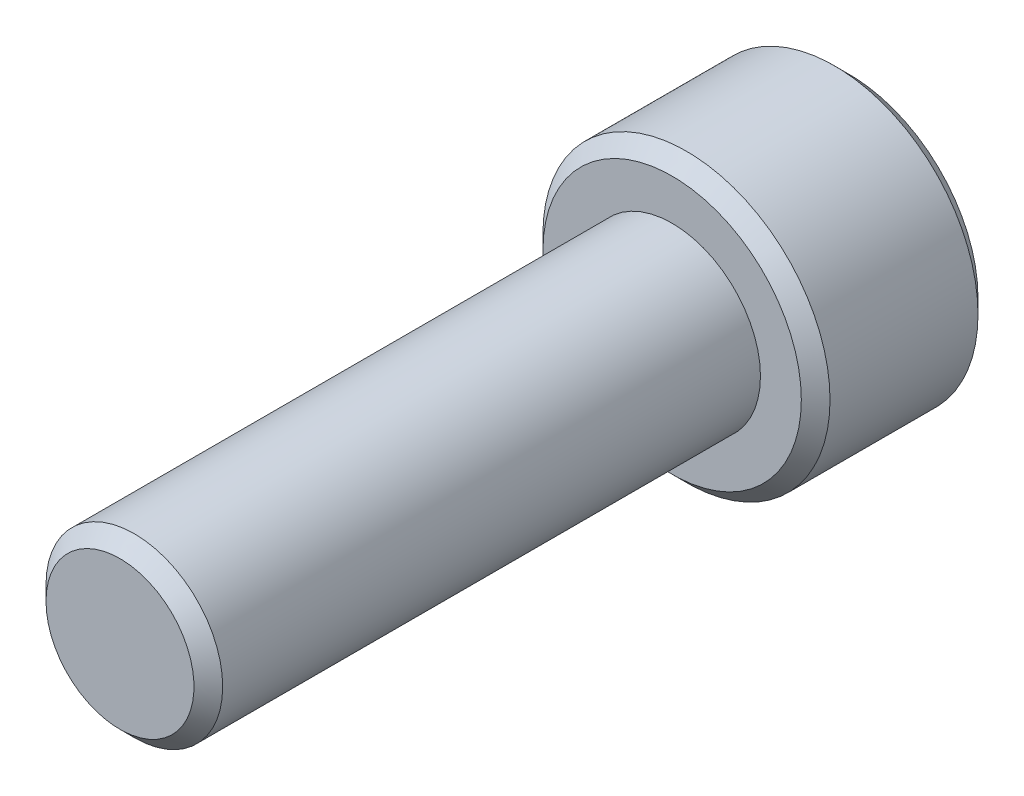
ISO-10303-21;
HEADER;
FILE_DESCRIPTION(('STEP AP214'),'2;1');
FILE_NAME('part.step','',(''),(''),'','','');
FILE_SCHEMA(('AUTOMOTIVE_DESIGN { 1 0 10303 214 1 1 1 1 }'));
ENDSEC;
DATA;
#1=APPLICATION_CONTEXT('core data for automotive mechanical design processes');
#2=APPLICATION_PROTOCOL_DEFINITION('international standard','automotive_design',2000,#1);
#3=PRODUCT_CONTEXT('',#1,'mechanical');
#4=PRODUCT('Part','Part','',(#3));
#5=PRODUCT_RELATED_PRODUCT_CATEGORY('part','',(#4));
#6=PRODUCT_DEFINITION_FORMATION('','',#4);
#7=PRODUCT_DEFINITION_CONTEXT('part definition',#1,'design');
#8=PRODUCT_DEFINITION('design','',#6,#7);
#9=PRODUCT_DEFINITION_SHAPE('','',#8);
#10=(LENGTH_UNIT() NAMED_UNIT(*) SI_UNIT(.MILLI.,.METRE.));
#11=(NAMED_UNIT(*) PLANE_ANGLE_UNIT() SI_UNIT($,.RADIAN.));
#12=(NAMED_UNIT(*) SI_UNIT($,.STERADIAN.) SOLID_ANGLE_UNIT());
#13=UNCERTAINTY_MEASURE_WITH_UNIT(LENGTH_MEASURE(1.E-05),#10,'distance_accuracy_value','');
#14=(GEOMETRIC_REPRESENTATION_CONTEXT(3) GLOBAL_UNCERTAINTY_ASSIGNED_CONTEXT((#13)) GLOBAL_UNIT_ASSIGNED_CONTEXT((#10,
#11,#12)) REPRESENTATION_CONTEXT('',''));
#15=CARTESIAN_POINT('',(0.,0.,0.));
#16=DIRECTION('',(0.,0.,1.));
#17=DIRECTION('',(1.,0.,0.));
#18=AXIS2_PLACEMENT_3D('',#15,#16,#17);
#19=CARTESIAN_POINT('',(3.,5.196152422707,-23.5));
#20=DIRECTION('',(0.,0.,-1.));
#21=DIRECTION('',(-1.,0.,0.));
#22=AXIS2_PLACEMENT_3D('',#19,#20,#21);
#23=PLANE('',#22);
#24=DIRECTION('',(0.866025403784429,0.500000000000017,0.));
#25=VECTOR('',#24,1.);
#26=CARTESIAN_POINT('',(3.,-1.732050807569,-23.5));
#27=LINE('',#26,#25);
#28=CARTESIAN_POINT('',(3.,-1.732050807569,-23.5));
#29=VERTEX_POINT('',#28);
#30=CARTESIAN_POINT('',(0.,-3.46410161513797,-23.5));
#31=VERTEX_POINT('',#30);
#32=EDGE_CURVE('E111',#29,#31,#27,.F.);
#33=ORIENTED_EDGE('',*,*,#32,.T.);
#34=DIRECTION('',(0.866025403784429,-0.500000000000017,0.));
#35=VECTOR('',#34,1.);
#36=CARTESIAN_POINT('',(0.,-3.464101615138,-23.5));
#37=LINE('',#36,#35);
#38=CARTESIAN_POINT('',(-3.00000000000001,-1.73205080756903,-23.5));
#39=VERTEX_POINT('',#38);
#40=EDGE_CURVE('E123',#31,#39,#37,.F.);
#41=ORIENTED_EDGE('',*,*,#40,.T.);
#42=DIRECTION('',(0.,1.,0.));
#43=VECTOR('',#42,1.);
#44=CARTESIAN_POINT('',(-3.,-1.732050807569,-23.5));
#45=LINE('',#44,#43);
#46=CARTESIAN_POINT('',(-3.,1.732050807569,-23.5));
#47=VERTEX_POINT('',#46);
#48=EDGE_CURVE('E86',#39,#47,#45,.T.);
#49=ORIENTED_EDGE('',*,*,#48,.T.);
#50=DIRECTION('',(-0.866025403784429,-0.500000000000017,0.));
#51=VECTOR('',#50,1.);
#52=CARTESIAN_POINT('',(-3.,1.732050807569,-23.5));
#53=LINE('',#52,#51);
#54=CARTESIAN_POINT('',(6.22408056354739E-12,3.46410161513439,-23.5));
#55=VERTEX_POINT('',#54);
#56=EDGE_CURVE('E88',#47,#55,#53,.F.);
#57=ORIENTED_EDGE('',*,*,#56,.T.);
#58=DIRECTION('',(-0.866025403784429,0.500000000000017,0.));
#59=VECTOR('',#58,1.);
#60=CARTESIAN_POINT('',(0.,3.464101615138,-23.5));
#61=LINE('',#60,#59);
#62=CARTESIAN_POINT('',(3.00000000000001,1.73205080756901,-23.5));
#63=VERTEX_POINT('',#62);
#64=EDGE_CURVE('E89',#55,#63,#61,.F.);
#65=ORIENTED_EDGE('',*,*,#64,.T.);
#66=DIRECTION('',(0.,1.,0.));
#67=VECTOR('',#66,1.);
#68=CARTESIAN_POINT('',(3.,1.732050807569,-23.5));
#69=LINE('',#68,#67);
#70=EDGE_CURVE('E74',#63,#29,#69,.F.);
#71=ORIENTED_EDGE('',*,*,#70,.T.);
#72=EDGE_LOOP('',(#33,#41,#49,#57,#65,#71));
#73=FACE_BOUND('',#72,.T.);
#74=ADVANCED_FACE('F16',(#73),#23,.T.);
#75=CARTESIAN_POINT('',(0.,3.464101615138,-23.5));
#76=DIRECTION('',(0.500000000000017,0.866025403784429,0.));
#77=DIRECTION('',(-0.866025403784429,0.500000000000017,0.));
#78=AXIS2_PLACEMENT_3D('',#75,#76,#77);
#79=PLANE('',#78);
#80=ORIENTED_EDGE('',*,*,#64,.F.);
#81=DIRECTION('',(0.,0.,1.));
#82=VECTOR('',#81,1.);
#83=CARTESIAN_POINT('',(0.,3.46410161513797,-23.5));
#84=LINE('',#83,#82);
#85=CARTESIAN_POINT('',(0.,3.46410161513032,-28.0000000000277));
#86=VERTEX_POINT('',#85);
#87=EDGE_CURVE('E58',#55,#86,#84,.F.);
#88=ORIENTED_EDGE('',*,*,#87,.T.);
#89=CARTESIAN_POINT('',(7.0007922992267E-12,3.46410161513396,-28.0000000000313));
#90=CARTESIAN_POINT('',(0.103111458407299,3.40457018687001,-27.9405256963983));
#91=CARTESIAN_POINT('',(0.207946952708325,3.34404338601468,-27.8845449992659));
#92=CARTESIAN_POINT('',(0.421717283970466,3.22062302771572,-27.7820467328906));
#93=CARTESIAN_POINT('',(0.530672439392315,3.15771773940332,-27.7355861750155));
#94=CARTESIAN_POINT('',(0.750375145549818,3.03087232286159,-27.6559989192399));
#95=CARTESIAN_POINT('',(0.861066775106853,2.96696448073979,-27.6226722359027));
#96=CARTESIAN_POINT('',(1.08488631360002,2.83774220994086,-27.571326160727));
#97=CARTESIAN_POINT('',(1.19800738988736,2.77243172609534,-27.5532684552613));
#98=CARTESIAN_POINT('',(1.39297651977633,2.65986624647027,-27.5369752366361));
#99=CARTESIAN_POINT('',(1.47457294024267,2.61275653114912,-27.534563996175));
#100=CARTESIAN_POINT('',(1.63763295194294,2.5186137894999,-27.5386315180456));
#101=CARTESIAN_POINT('',(1.71909648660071,2.4715807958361,-27.5451133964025));
#102=CARTESIAN_POINT('',(1.8812516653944,2.37796045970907,-27.5665970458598));
#103=CARTESIAN_POINT('',(1.96194234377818,2.33137367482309,-27.5816083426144));
#104=CARTESIAN_POINT('',(2.12193782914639,2.23900023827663,-27.6193315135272));
#105=CARTESIAN_POINT('',(2.20124274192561,2.19321352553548,-27.6420427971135));
#106=CARTESIAN_POINT('',(2.34201325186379,2.11193963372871,-27.6887637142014));
#107=CARTESIAN_POINT('',(2.40379080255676,2.07627234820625,-27.711543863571));
#108=CARTESIAN_POINT('',(2.52623714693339,2.00557791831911,-27.760774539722));
#109=CARTESIAN_POINT('',(2.58690590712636,1.9705507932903,-27.7872251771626));
#110=CARTESIAN_POINT('',(2.70694350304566,1.90124705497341,-27.8432040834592));
#111=CARTESIAN_POINT('',(2.76631575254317,1.86696847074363,-27.8727226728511));
#112=CARTESIAN_POINT('',(2.88396102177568,1.79904594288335,-27.9344500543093));
#113=CARTESIAN_POINT('',(2.94223468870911,1.76540162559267,-27.9666571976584));
#114=CARTESIAN_POINT('',(2.99999999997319,1.73205080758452,-28.0000000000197));
#115=B_SPLINE_CURVE_WITH_KNOTS('',3,(#89,#90,#91,#92,#93,#94,#95,#96,#97,#98,#99,#100,#101,#102,
#103,#104,#105,#106,#107,#108,#109,#110,#111,#112,#113,#114),.UNSPECIFIED.,.F.,.F.,(4,2,2,2,2,2,
2,2,2,2,2,2,4),(0.,0.399548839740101,0.801424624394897,1.19691998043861,1.59141997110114,
1.87377108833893,2.15622116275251,2.43898729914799,2.72173175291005,2.94627735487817,
3.17082972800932,3.39469398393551,3.61842195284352),.UNSPECIFIED.);
#116=CARTESIAN_POINT('',(2.99999999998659,1.73205080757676,-28.0000000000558));
#117=VERTEX_POINT('',#116);
#118=EDGE_CURVE('E19',#86,#117,#115,.T.);
#119=ORIENTED_EDGE('',*,*,#118,.T.);
#120=DIRECTION('',(0.,0.,-1.));
#121=VECTOR('',#120,1.);
#122=CARTESIAN_POINT('',(3.,1.732050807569,-23.5));
#123=LINE('',#122,#121);
#124=EDGE_CURVE('E96',#117,#63,#123,.F.);
#125=ORIENTED_EDGE('',*,*,#124,.T.);
#126=EDGE_LOOP('',(#80,#88,#119,#125));
#127=FACE_BOUND('',#126,.T.);
#128=ADVANCED_FACE('F95',(#127),#79,.F.);
#129=CARTESIAN_POINT('',(-3.,1.732050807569,-23.5));
#130=DIRECTION('',(-0.500000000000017,0.866025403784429,0.));
#131=DIRECTION('',(-0.866025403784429,-0.500000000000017,0.));
#132=AXIS2_PLACEMENT_3D('',#129,#130,#131);
#133=PLANE('',#132);
#134=ORIENTED_EDGE('',*,*,#56,.F.);
#135=DIRECTION('',(0.,0.,1.));
#136=VECTOR('',#135,1.);
#137=CARTESIAN_POINT('',(-3.,1.732050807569,-23.5));
#138=LINE('',#137,#136);
#139=CARTESIAN_POINT('',(-3.,1.732050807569,-28.000000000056));
#140=VERTEX_POINT('',#139);
#141=EDGE_CURVE('E103',#47,#140,#138,.F.);
#142=ORIENTED_EDGE('',*,*,#141,.T.);
#143=CARTESIAN_POINT('',(-3.0000000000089,1.73205080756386,-28.0000000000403));
#144=CARTESIAN_POINT('',(-2.89688854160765,1.79158223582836,-27.9405256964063));
#145=CARTESIAN_POINT('',(-2.79205304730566,1.85210903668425,-27.8845449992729));
#146=CARTESIAN_POINT('',(-2.57828271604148,1.97552939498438,-27.7820467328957));
#147=CARTESIAN_POINT('',(-2.46932756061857,2.0384346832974,-27.7355861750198));
#148=CARTESIAN_POINT('',(-2.24962485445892,2.16528009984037,-27.6559989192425));
#149=CARTESIAN_POINT('',(-2.1389332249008,2.22918794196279,-27.6226722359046));
#150=CARTESIAN_POINT('',(-1.91511368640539,2.35841021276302,-27.5713261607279));
#151=CARTESIAN_POINT('',(-1.80199261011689,2.4237206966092,-27.5532684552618));
#152=CARTESIAN_POINT('',(-1.60702348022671,2.53628617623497,-27.5369752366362));
#153=CARTESIAN_POINT('',(-1.52542705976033,2.58339589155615,-27.534563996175));
#154=CARTESIAN_POINT('',(-1.36236704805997,2.67753863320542,-27.5386315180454));
#155=CARTESIAN_POINT('',(-1.28090351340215,2.72457162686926,-27.5451133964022));
#156=CARTESIAN_POINT('',(-1.11874833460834,2.81819196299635,-27.5665970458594));
#157=CARTESIAN_POINT('',(-1.0380576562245,2.86477874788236,-27.5816083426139));
#158=CARTESIAN_POINT('',(-0.878062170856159,2.9571521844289,-27.6193315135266));
#159=CARTESIAN_POINT('',(-0.798757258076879,3.00293889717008,-27.6420427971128));
#160=CARTESIAN_POINT('',(-0.657986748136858,3.08421278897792,-27.6887637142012));
#161=CARTESIAN_POINT('',(-0.596209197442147,3.11988007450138,-27.7115438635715));
#162=CARTESIAN_POINT('',(-0.47376285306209,3.1905745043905,-27.7607745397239));
#163=CARTESIAN_POINT('',(-0.413094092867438,3.22560162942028,-27.7872251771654));
#164=CARTESIAN_POINT('',(-0.293056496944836,3.29490536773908,-27.8432040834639));
#165=CARTESIAN_POINT('',(-0.23368424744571,3.32918395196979,-27.8727226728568));
#166=CARTESIAN_POINT('',(-0.116038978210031,3.3971064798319,-27.9344500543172));
#167=CARTESIAN_POINT('',(-0.0577653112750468,3.43075079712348,-27.9666571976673));
#168=CARTESIAN_POINT('',(-9.43404763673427E-12,3.46410161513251,-28.0000000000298));
#169=B_SPLINE_CURVE_WITH_KNOTS('',3,(#143,#144,#145,#146,#147,#148,#149,#150,#151,#152,#153,
#154,#155,#156,#157,#158,#159,#160,#161,#162,#163,#164,#165,#166,#167,#168),.UNSPECIFIED.,.F.,
.F.,(4,2,2,2,2,2,2,2,2,2,2,2,4),(0.,0.399548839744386,0.801424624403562,1.19691998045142,
1.59141997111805,1.873771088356,2.15622116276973,2.43898729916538,2.72173175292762,
2.94627735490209,3.1708297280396,3.39469398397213,3.61842195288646),.UNSPECIFIED.);
#170=EDGE_CURVE('E100',#140,#86,#169,.T.);
#171=ORIENTED_EDGE('',*,*,#170,.T.);
#172=ORIENTED_EDGE('',*,*,#87,.F.);
#173=EDGE_LOOP('',(#134,#142,#171,#172));
#174=FACE_BOUND('',#173,.T.);
#175=ADVANCED_FACE('F98',(#174),#133,.F.);
#176=CARTESIAN_POINT('',(-3.,-1.732050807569,-23.5));
#177=DIRECTION('',(-1.,0.,0.));
#178=DIRECTION('',(0.,0.,1.));
#179=AXIS2_PLACEMENT_3D('',#176,#177,#178);
#180=PLANE('',#179);
#181=ORIENTED_EDGE('',*,*,#141,.F.);
#182=ORIENTED_EDGE('',*,*,#48,.F.);
#183=DIRECTION('',(0.,0.,1.));
#184=VECTOR('',#183,1.);
#185=CARTESIAN_POINT('',(-3.00000000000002,-1.73205080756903,-23.5));
#186=LINE('',#185,#184);
#187=CARTESIAN_POINT('',(-3.00000000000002,-1.73205080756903,-28.0000000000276));
#188=VERTEX_POINT('',#187);
#189=EDGE_CURVE('E114',#39,#188,#186,.F.);
#190=ORIENTED_EDGE('',*,*,#189,.T.);
#191=CARTESIAN_POINT('',(-2.99999999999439,-1.73205080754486,-28.000000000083));
#192=CARTESIAN_POINT('',(-2.99999999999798,-1.61376575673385,-27.9409126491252));
#193=CARTESIAN_POINT('',(-2.99999999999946,-1.49351557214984,-27.8852754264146));
#194=CARTESIAN_POINT('',(-3.00000000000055,-1.24826765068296,-27.7832912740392));
#195=CARTESIAN_POINT('',(-3.00000000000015,-1.12324441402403,-27.7370062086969));
#196=CARTESIAN_POINT('',(-2.99999999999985,-0.869584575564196,-27.6570818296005));
#197=CARTESIAN_POINT('',(-2.99999999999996,-0.740961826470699,-27.6233997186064));
#198=CARTESIAN_POINT('',(-3.00000000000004,-0.480896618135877,-27.5715447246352));
#199=CARTESIAN_POINT('',(-3.,-0.349464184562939,-27.5533238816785));
#200=CARTESIAN_POINT('',(-3.,-0.181294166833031,-27.541151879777));
#201=CARTESIAN_POINT('',(-3.,-0.145053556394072,-27.5391840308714));
#202=CARTESIAN_POINT('',(-3.,-0.0725435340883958,-27.5365571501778));
#203=CARTESIAN_POINT('',(-3.,-0.0362741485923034,-27.5358974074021));
#204=CARTESIAN_POINT('',(-3.,0.0910409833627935,-27.5359008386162));
#205=CARTESIAN_POINT('',(-3.,0.182111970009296,-27.5400652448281));
#206=CARTESIAN_POINT('',(-3.,0.363556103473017,-27.5564932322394));
#207=CARTESIAN_POINT('',(-3.,0.453928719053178,-27.5687624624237));
#208=CARTESIAN_POINT('',(-3.,0.63374780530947,-27.6008240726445));
#209=CARTESIAN_POINT('',(-3.,0.72318803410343,-27.6206510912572));
#210=CARTESIAN_POINT('',(-3.,0.900347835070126,-27.6669214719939));
#211=CARTESIAN_POINT('',(-3.,0.988066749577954,-27.6933673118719));
#212=CARTESIAN_POINT('',(-3.,1.18810094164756,-27.760833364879));
#213=CARTESIAN_POINT('',(-3.,1.29974585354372,-27.803837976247));
#214=CARTESIAN_POINT('',(-3.,1.46423831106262,-27.873796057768));
#215=CARTESIAN_POINT('',(-3.,1.51833281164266,-27.8979015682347));
#216=CARTESIAN_POINT('',(-3.,1.62575498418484,-27.9477632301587));
#217=CARTESIAN_POINT('',(-3.,1.67908267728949,-27.9735193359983));
#218=CARTESIAN_POINT('',(-3.,1.73205080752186,-28.0000000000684));
#219=B_SPLINE_CURVE_WITH_KNOTS('',3,(#191,#192,#193,#194,#195,#196,#197,#198,#199,#200,#201,
#202,#203,#204,#205,#206,#207,#208,#209,#210,#211,#212,#213,#214,#215,#216,#217,#218),
.UNSPECIFIED.,.F.,.F.,(4,2,2,2,2,2,2,2,2,2,2,2,2,4),(0.,0.396939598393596,0.796424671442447,
1.19454058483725,1.59141700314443,1.70028274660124,1.80908930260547,2.08217237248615,
2.35544597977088,2.6299874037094,2.90463175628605,3.26315842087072,3.44080555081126,
3.61844777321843),.UNSPECIFIED.);
#220=EDGE_CURVE('E201',#188,#140,#219,.T.);
#221=ORIENTED_EDGE('',*,*,#220,.T.);
#222=EDGE_LOOP('',(#181,#182,#190,#221));
#223=FACE_BOUND('',#222,.T.);
#224=ADVANCED_FACE('F211',(#223),#180,.F.);
#225=CARTESIAN_POINT('',(0.,-3.464101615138,-23.5));
#226=DIRECTION('',(-0.500000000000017,-0.866025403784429,0.));
#227=DIRECTION('',(0.866025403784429,-0.500000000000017,0.));
#228=AXIS2_PLACEMENT_3D('',#225,#226,#227);
#229=PLANE('',#228);
#230=ORIENTED_EDGE('',*,*,#40,.F.);
#231=DIRECTION('',(0.,0.,1.));
#232=VECTOR('',#231,1.);
#233=CARTESIAN_POINT('',(0.,-3.46410161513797,-23.5));
#234=LINE('',#233,#232);
#235=CARTESIAN_POINT('',(1.26969580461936E-11,-3.46410161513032,-28.0000000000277));
#236=VERTEX_POINT('',#235);
#237=EDGE_CURVE('E113',#31,#236,#234,.F.);
#238=ORIENTED_EDGE('',*,*,#237,.T.);
#239=CARTESIAN_POINT('',(6.55782055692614E-12,-3.46410161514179,-28.0000000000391));
#240=CARTESIAN_POINT('',(-0.103111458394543,-3.40457018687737,-27.9405256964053));
#241=CARTESIAN_POINT('',(-0.207946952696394,-3.34404338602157,-27.884544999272));
#242=CARTESIAN_POINT('',(-0.421717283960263,-3.22062302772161,-27.7820467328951));
#243=CARTESIAN_POINT('',(-0.530672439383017,-3.15771773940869,-27.7355861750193));
#244=CARTESIAN_POINT('',(-0.750375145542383,-3.03087232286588,-27.6559989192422));
#245=CARTESIAN_POINT('',(-0.861066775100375,-2.96696448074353,-27.6226722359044));
#246=CARTESIAN_POINT('',(-1.08488631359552,-2.83774220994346,-27.5713261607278));
#247=CARTESIAN_POINT('',(-1.19800738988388,-2.77243172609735,-27.5532684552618));
#248=CARTESIAN_POINT('',(-1.39297651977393,-2.65986624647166,-27.5369752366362));
#249=CARTESIAN_POINT('',(-1.47457294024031,-2.61275653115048,-27.5345639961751));
#250=CARTESIAN_POINT('',(-1.63763295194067,-2.51861378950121,-27.5386315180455));
#251=CARTESIAN_POINT('',(-1.71909648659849,-2.47158079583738,-27.5451133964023));
#252=CARTESIAN_POINT('',(-1.88125166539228,-2.37796045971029,-27.5665970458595));
#253=CARTESIAN_POINT('',(-1.96194234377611,-2.33137367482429,-27.581608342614));
#254=CARTESIAN_POINT('',(-2.12193782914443,-2.23900023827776,-27.6193315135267));
#255=CARTESIAN_POINT('',(-2.20124274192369,-2.19321352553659,-27.6420427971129));
#256=CARTESIAN_POINT('',(-2.34201325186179,-2.11193963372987,-27.6887637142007));
#257=CARTESIAN_POINT('',(-2.40379080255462,-2.07627234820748,-27.7115438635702));
#258=CARTESIAN_POINT('',(-2.52623714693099,-2.0055779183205,-27.760774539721));
#259=CARTESIAN_POINT('',(-2.58690590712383,-1.97055079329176,-27.7872251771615));
#260=CARTESIAN_POINT('',(-2.70694350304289,-1.90124705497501,-27.8432040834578));
#261=CARTESIAN_POINT('',(-2.76631575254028,-1.86696847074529,-27.8727226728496));
#262=CARTESIAN_POINT('',(-2.88396102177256,-1.79904594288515,-27.9344500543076));
#263=CARTESIAN_POINT('',(-2.94223468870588,-1.76540162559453,-27.9666571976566));
#264=CARTESIAN_POINT('',(-2.99999999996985,-1.73205080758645,-28.0000000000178));
#265=B_SPLINE_CURVE_WITH_KNOTS('',3,(#239,#240,#241,#242,#243,#244,#245,#246,#247,#248,#249,
#250,#251,#252,#253,#254,#255,#256,#257,#258,#259,#260,#261,#262,#263,#264),.UNSPECIFIED.,.F.,
.F.,(4,2,2,2,2,2,2,2,2,2,2,2,4),(0.,0.399548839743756,0.801424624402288,1.19691998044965,
1.5914199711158,1.87377108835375,2.15622116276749,2.4389872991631,2.7217317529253,
2.94627735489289,3.17082972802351,3.3946939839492,3.61842195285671),.UNSPECIFIED.);
#266=EDGE_CURVE('E193',#236,#188,#265,.T.);
#267=ORIENTED_EDGE('',*,*,#266,.T.);
#268=ORIENTED_EDGE('',*,*,#189,.F.);
#269=EDGE_LOOP('',(#230,#238,#267,#268));
#270=FACE_BOUND('',#269,.T.);
#271=ADVANCED_FACE('F207',(#270),#229,.F.);
#272=CARTESIAN_POINT('',(3.,-1.732050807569,-23.5));
#273=DIRECTION('',(0.500000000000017,-0.866025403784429,0.));
#274=DIRECTION('',(0.866025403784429,0.500000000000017,0.));
#275=AXIS2_PLACEMENT_3D('',#272,#273,#274);
#276=PLANE('',#275);
#277=ORIENTED_EDGE('',*,*,#32,.F.);
#278=DIRECTION('',(0.,0.,-1.));
#279=VECTOR('',#278,1.);
#280=CARTESIAN_POINT('',(3.,-1.732050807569,-23.5));
#281=LINE('',#280,#279);
#282=CARTESIAN_POINT('',(2.99999999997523,-1.73205080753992,-28.000000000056));
#283=VERTEX_POINT('',#282);
#284=EDGE_CURVE('E118',#29,#283,#281,.T.);
#285=ORIENTED_EDGE('',*,*,#284,.T.);
#286=CARTESIAN_POINT('',(3.00000000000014,-1.73205080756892,-28.0000000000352));
#287=CARTESIAN_POINT('',(2.89688854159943,-1.7915822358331,-27.9405256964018));
#288=CARTESIAN_POINT('',(2.79205304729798,-1.85210903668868,-27.884544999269));
#289=CARTESIAN_POINT('',(2.57828271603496,-1.97552939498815,-27.7820467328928));
#290=CARTESIAN_POINT('',(2.46932756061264,-2.03843468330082,-27.7355861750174));
#291=CARTESIAN_POINT('',(2.24962485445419,-2.1652800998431,-27.655998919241));
#292=CARTESIAN_POINT('',(2.13893322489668,-2.22918794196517,-27.6226722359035));
#293=CARTESIAN_POINT('',(1.91511368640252,-2.35841021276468,-27.5713261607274));
#294=CARTESIAN_POINT('',(1.80199261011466,-2.42372069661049,-27.5532684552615));
#295=CARTESIAN_POINT('',(1.60702348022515,-2.53628617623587,-27.5369752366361));
#296=CARTESIAN_POINT('',(1.52542705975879,-2.58339589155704,-27.534563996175));
#297=CARTESIAN_POINT('',(1.36236704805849,-2.67753863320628,-27.5386315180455));
#298=CARTESIAN_POINT('',(1.28090351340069,-2.7245716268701,-27.5451133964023));
#299=CARTESIAN_POINT('',(1.11874833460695,-2.81819196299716,-27.5665970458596));
#300=CARTESIAN_POINT('',(1.03805765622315,-2.86477874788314,-27.5816083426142));
#301=CARTESIAN_POINT('',(0.878062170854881,-2.95715218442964,-27.6193315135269));
#302=CARTESIAN_POINT('',(0.798757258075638,-3.0029388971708,-27.6420427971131));
#303=CARTESIAN_POINT('',(0.657986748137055,-3.0842127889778,-27.6887637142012));
#304=CARTESIAN_POINT('',(0.596209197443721,-3.11988007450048,-27.7115438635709));
#305=CARTESIAN_POINT('',(0.473762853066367,-3.19057450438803,-27.7607745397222));
#306=CARTESIAN_POINT('',(0.413094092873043,-3.22560162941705,-27.787225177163));
#307=CARTESIAN_POINT('',(0.293056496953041,-3.29490536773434,-27.8432040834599));
#308=CARTESIAN_POINT('',(0.233684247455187,-3.32918395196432,-27.872722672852));
#309=CARTESIAN_POINT('',(0.116038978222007,-3.39710647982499,-27.9344500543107));
#310=CARTESIAN_POINT('',(0.0577653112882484,-3.43075079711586,-27.9666571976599));
#311=CARTESIAN_POINT('',(2.38431813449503E-11,-3.46410161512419,-28.0000000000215));
#312=B_SPLINE_CURVE_WITH_KNOTS('',3,(#286,#287,#288,#289,#290,#291,#292,#293,#294,#295,#296,
#297,#298,#299,#300,#301,#302,#303,#304,#305,#306,#307,#308,#309,#310,#311),.UNSPECIFIED.,.F.,
.F.,(4,2,2,2,2,2,2,2,2,2,2,2,4),(0.,0.399548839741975,0.801424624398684,1.19691998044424,
1.59141997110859,1.87377108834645,2.1562211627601,2.43898729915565,2.72173175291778,
2.94627735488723,3.17082972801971,3.39469398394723,3.61842195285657),.UNSPECIFIED.);
#313=EDGE_CURVE('E163',#283,#236,#312,.T.);
#314=ORIENTED_EDGE('',*,*,#313,.T.);
#315=ORIENTED_EDGE('',*,*,#237,.F.);
#316=EDGE_LOOP('',(#277,#285,#314,#315));
#317=FACE_BOUND('',#316,.T.);
#318=ADVANCED_FACE('F210',(#317),#276,.F.);
#319=CARTESIAN_POINT('',(3.,1.732050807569,-23.5));
#320=DIRECTION('',(1.,0.,0.));
#321=DIRECTION('',(0.,0.,-1.));
#322=AXIS2_PLACEMENT_3D('',#319,#320,#321);
#323=PLANE('',#322);
#324=ORIENTED_EDGE('',*,*,#284,.F.);
#325=ORIENTED_EDGE('',*,*,#70,.F.);
#326=ORIENTED_EDGE('',*,*,#124,.F.);
#327=CARTESIAN_POINT('',(2.99999999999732,1.73205080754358,-28.0000000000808));
#328=CARTESIAN_POINT('',(2.99999999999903,1.61376575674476,-27.9409126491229));
#329=CARTESIAN_POINT('',(2.99999999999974,1.49351557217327,-27.8852754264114));
#330=CARTESIAN_POINT('',(3.00000000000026,1.24826765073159,-27.7832912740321));
#331=CARTESIAN_POINT('',(3.00000000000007,1.12324441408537,-27.7370062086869));
#332=CARTESIAN_POINT('',(2.99999999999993,0.86958457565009,-27.6570818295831));
#333=CARTESIAN_POINT('',(2.99999999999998,0.740961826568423,-27.6233997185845));
#334=CARTESIAN_POINT('',(3.00000000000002,0.480896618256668,-27.5715447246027));
#335=CARTESIAN_POINT('',(3.,0.34946418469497,-27.5533238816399));
#336=CARTESIAN_POINT('',(3.,0.181294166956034,-27.5411518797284));
#337=CARTESIAN_POINT('',(3.,0.145053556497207,-27.53918403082));
#338=CARTESIAN_POINT('',(3.,0.0725435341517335,-27.5365571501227));
#339=CARTESIAN_POINT('',(3.,0.0362741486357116,-27.5358974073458));
#340=CARTESIAN_POINT('',(3.,-0.0910409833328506,-27.535900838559));
#341=CARTESIAN_POINT('',(3.,-0.182111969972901,-27.5400652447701));
#342=CARTESIAN_POINT('',(3.,-0.363556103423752,-27.5564932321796));
#343=CARTESIAN_POINT('',(3.,-0.453928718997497,-27.5687624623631));
#344=CARTESIAN_POINT('',(3.,-0.633747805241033,-27.6008240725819));
#345=CARTESIAN_POINT('',(3.,-0.723188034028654,-27.6206510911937));
#346=CARTESIAN_POINT('',(3.,-0.900347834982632,-27.6669214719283));
#347=CARTESIAN_POINT('',(3.,-0.988066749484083,-27.6933673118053));
#348=CARTESIAN_POINT('',(3.,-1.18810094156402,-27.7608333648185));
#349=CARTESIAN_POINT('',(3.,-1.29974585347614,-27.8038379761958));
#350=CARTESIAN_POINT('',(3.,-1.46423831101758,-27.8737960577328));
#351=CARTESIAN_POINT('',(3.,-1.51833281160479,-27.8979015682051));
#352=CARTESIAN_POINT('',(3.,-1.62575498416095,-27.9477632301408));
#353=CARTESIAN_POINT('',(3.,-1.6790826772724,-27.9735193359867));
#354=CARTESIAN_POINT('',(3.,-1.73205080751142,-28.0000000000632));
#355=B_SPLINE_CURVE_WITH_KNOTS('',3,(#327,#328,#329,#330,#331,#332,#333,#334,#335,#336,#337,
#338,#339,#340,#341,#342,#343,#344,#345,#346,#347,#348,#349,#350,#351,#352,#353,#354),
.UNSPECIFIED.,.F.,.F.,(4,2,2,2,2,2,2,2,2,2,2,2,2,4),(0.,0.396939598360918,0.796424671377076,
1.19454058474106,1.59141700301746,1.70028274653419,1.80908930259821,2.08217237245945,
2.35544597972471,2.62998740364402,2.90463175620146,3.26315842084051,3.44080555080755,
3.61844777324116),.UNSPECIFIED.);
#356=EDGE_CURVE('E39',#117,#283,#355,.T.);
#357=ORIENTED_EDGE('',*,*,#356,.T.);
#358=EDGE_LOOP('',(#324,#325,#326,#357));
#359=FACE_BOUND('',#358,.T.);
#360=ADVANCED_FACE('F171',(#359),#323,.F.);
#361=CARTESIAN_POINT('',(0.,0.,-27.9999999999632));
#362=DIRECTION('',(0.,0.,-1.));
#363=DIRECTION('',(0.,1.,0.));
#364=AXIS2_PLACEMENT_3D('',#361,#362,#363);
#365=CONICAL_SURFACE('',#364,3.46410161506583,0.785398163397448);
#366=ORIENTED_EDGE('',*,*,#118,.F.);
#367=CARTESIAN_POINT('',(0.,0.,-28.00000000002));
#368=DIRECTION('',(0.,0.,-1.));
#369=DIRECTION('',(0.,1.,0.));
#370=AXIS2_PLACEMENT_3D('',#367,#368,#369);
#371=CIRCLE('',#370,3.46410161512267);
#372=EDGE_CURVE('E154',#117,#86,#371,.F.);
#373=ORIENTED_EDGE('',*,*,#372,.F.);
#374=EDGE_LOOP('',(#366,#373));
#375=FACE_BOUND('',#374,.T.);
#376=ADVANCED_FACE('F228',(#375),#365,.F.);
#377=CARTESIAN_POINT('',(0.,0.,-27.9999999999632));
#378=DIRECTION('',(0.,0.,-1.));
#379=DIRECTION('',(0.,1.,0.));
#380=AXIS2_PLACEMENT_3D('',#377,#378,#379);
#381=CONICAL_SURFACE('',#380,3.46410161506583,0.785398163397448);
#382=ORIENTED_EDGE('',*,*,#170,.F.);
#383=CARTESIAN_POINT('',(0.,0.,-28.00000000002));
#384=DIRECTION('',(0.,0.,-1.));
#385=DIRECTION('',(0.,1.,0.));
#386=AXIS2_PLACEMENT_3D('',#383,#384,#385);
#387=CIRCLE('',#386,3.46410161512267);
#388=EDGE_CURVE('E151',#86,#140,#387,.F.);
#389=ORIENTED_EDGE('',*,*,#388,.F.);
#390=EDGE_LOOP('',(#382,#389));
#391=FACE_BOUND('',#390,.T.);
#392=ADVANCED_FACE('F225',(#391),#381,.F.);
#393=CARTESIAN_POINT('',(0.,0.,-28.0000000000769));
#394=DIRECTION('',(0.,0.,-1.));
#395=DIRECTION('',(-1.,0.,0.));
#396=AXIS2_PLACEMENT_3D('',#393,#394,#395);
#397=CONICAL_SURFACE('',#396,3.46410161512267,0.785398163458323);
#398=CARTESIAN_POINT('',(0.,0.,-27.9999999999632));
#399=DIRECTION('',(0.,0.,-1.));
#400=DIRECTION('',(-1.,0.,0.));
#401=AXIS2_PLACEMENT_3D('',#398,#399,#400);
#402=CIRCLE('',#401,3.46410161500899);
#403=EDGE_CURVE('E148',#140,#188,#402,.F.);
#404=ORIENTED_EDGE('',*,*,#403,.F.);
#405=ORIENTED_EDGE('',*,*,#220,.F.);
#406=EDGE_LOOP('',(#404,#405));
#407=FACE_BOUND('',#406,.T.);
#408=ADVANCED_FACE('F189',(#407),#397,.F.);
#409=CARTESIAN_POINT('',(0.,0.,-27.9999999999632));
#410=DIRECTION('',(0.,0.,-1.));
#411=DIRECTION('',(0.,1.,0.));
#412=AXIS2_PLACEMENT_3D('',#409,#410,#411);
#413=CONICAL_SURFACE('',#412,3.46410161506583,0.785398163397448);
#414=ORIENTED_EDGE('',*,*,#266,.F.);
#415=CARTESIAN_POINT('',(0.,0.,-28.00000000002));
#416=DIRECTION('',(0.,0.,-1.));
#417=DIRECTION('',(0.,1.,0.));
#418=AXIS2_PLACEMENT_3D('',#415,#416,#417);
#419=CIRCLE('',#418,3.46410161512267);
#420=EDGE_CURVE('E145',#188,#236,#419,.F.);
#421=ORIENTED_EDGE('',*,*,#420,.F.);
#422=EDGE_LOOP('',(#414,#421));
#423=FACE_BOUND('',#422,.T.);
#424=ADVANCED_FACE('F184',(#423),#413,.F.);
#425=CARTESIAN_POINT('',(0.,0.,-27.9999999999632));
#426=DIRECTION('',(0.,0.,-1.));
#427=DIRECTION('',(0.,1.,0.));
#428=AXIS2_PLACEMENT_3D('',#425,#426,#427);
#429=CONICAL_SURFACE('',#428,3.46410161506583,0.785398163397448);
#430=ORIENTED_EDGE('',*,*,#313,.F.);
#431=CARTESIAN_POINT('',(0.,0.,-28.00000000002));
#432=DIRECTION('',(0.,0.,-1.));
#433=DIRECTION('',(0.,1.,0.));
#434=AXIS2_PLACEMENT_3D('',#431,#432,#433);
#435=CIRCLE('',#434,3.46410161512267);
#436=EDGE_CURVE('E143',#236,#283,#435,.F.);
#437=ORIENTED_EDGE('',*,*,#436,.F.);
#438=EDGE_LOOP('',(#430,#437));
#439=FACE_BOUND('',#438,.T.);
#440=ADVANCED_FACE('F178',(#439),#429,.F.);
#441=CARTESIAN_POINT('',(0.,0.,-28.00000000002));
#442=DIRECTION('',(0.,0.,-1.));
#443=DIRECTION('',(-1.,0.,0.));
#444=AXIS2_PLACEMENT_3D('',#441,#442,#443);
#445=CONICAL_SURFACE('',#444,3.46410161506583,0.785398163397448);
#446=ORIENTED_EDGE('',*,*,#356,.F.);
#447=CARTESIAN_POINT('',(0.,0.,-28.00000000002));
#448=DIRECTION('',(0.,0.,-1.));
#449=DIRECTION('',(-1.,0.,0.));
#450=AXIS2_PLACEMENT_3D('',#447,#448,#449);
#451=CIRCLE('',#450,3.46410161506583);
#452=EDGE_CURVE('E66',#283,#117,#451,.F.);
#453=ORIENTED_EDGE('',*,*,#452,.F.);
#454=EDGE_LOOP('',(#446,#453));
#455=FACE_BOUND('',#454,.T.);
#456=ADVANCED_FACE('F173',(#455),#445,.F.);
#457=CARTESIAN_POINT('',(0.,0.,-28.));
#458=DIRECTION('',(0.,0.,-1.));
#459=DIRECTION('',(-1.,0.,0.));
#460=AXIS2_PLACEMENT_3D('',#457,#458,#459);
#461=PLANE('',#460);
#462=ORIENTED_EDGE('',*,*,#436,.T.);
#463=ORIENTED_EDGE('',*,*,#452,.T.);
#464=ORIENTED_EDGE('',*,*,#372,.T.);
#465=ORIENTED_EDGE('',*,*,#388,.T.);
#466=ORIENTED_EDGE('',*,*,#403,.T.);
#467=ORIENTED_EDGE('',*,*,#420,.T.);
#468=EDGE_LOOP('',(#462,#463,#464,#465,#466,#467));
#469=FACE_BOUND('',#468,.T.);
#470=CARTESIAN_POINT('',(0.,0.,-28.00000000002));
#471=DIRECTION('',(0.,0.,1.));
#472=DIRECTION('',(1.,0.,0.));
#473=AXIS2_PLACEMENT_3D('',#470,#471,#472);
#474=CIRCLE('',#473,5.84999999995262);
#475=CARTESIAN_POINT('',(5.84999999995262,0.,-28.00000000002));
#476=VERTEX_POINT('',#475);
#477=EDGE_CURVE('E138',#476,#476,#474,.T.);
#478=ORIENTED_EDGE('',*,*,#477,.F.);
#479=EDGE_LOOP('',(#478));
#480=FACE_BOUND('',#479,.T.);
#481=ADVANCED_FACE('F177',(#469,#480),#461,.T.);
#482=CARTESIAN_POINT('',(0.,0.,-27.3499999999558));
#483=DIRECTION('',(0.,0.,1.));
#484=DIRECTION('',(1.,0.,0.));
#485=AXIS2_PLACEMENT_3D('',#482,#483,#484);
#486=CONICAL_SURFACE('',#485,6.50000000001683,0.785398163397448);
#487=CARTESIAN_POINT('',(0.,0.,-27.34999999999));
#488=DIRECTION('',(0.,0.,1.));
#489=DIRECTION('',(1.,0.,0.));
#490=AXIS2_PLACEMENT_3D('',#487,#488,#489);
#491=CIRCLE('',#490,6.5);
#492=CARTESIAN_POINT('',(6.5,0.,-27.34999999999));
#493=VERTEX_POINT('',#492);
#494=EDGE_CURVE('E141',#493,#493,#491,.T.);
#495=ORIENTED_EDGE('',*,*,#494,.F.);
#496=EDGE_LOOP('',(#495));
#497=FACE_BOUND('',#496,.T.);
#498=ORIENTED_EDGE('',*,*,#477,.T.);
#499=EDGE_LOOP('',(#498));
#500=FACE_BOUND('',#499,.T.);
#501=ADVANCED_FACE('F263',(#497,#500),#486,.T.);
#502=CARTESIAN_POINT('',(0.,0.,-28.));
#503=DIRECTION('',(0.,0.,1.));
#504=DIRECTION('',(1.,0.,0.));
#505=AXIS2_PLACEMENT_3D('',#502,#503,#504);
#506=CYLINDRICAL_SURFACE('',#505,6.5);
#507=CARTESIAN_POINT('',(0.,0.,-20.6500000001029));
#508=DIRECTION('',(0.,0.,-1.));
#509=DIRECTION('',(-1.,0.,0.));
#510=AXIS2_PLACEMENT_3D('',#507,#508,#509);
#511=CIRCLE('',#510,6.50000000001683);
#512=CARTESIAN_POINT('',(-6.50000000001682,0.,-20.6500000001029));
#513=VERTEX_POINT('',#512);
#514=EDGE_CURVE('E137',#513,#513,#511,.F.);
#515=ORIENTED_EDGE('',*,*,#514,.F.);
#516=EDGE_LOOP('',(#515));
#517=FACE_BOUND('',#516,.T.);
#518=ORIENTED_EDGE('',*,*,#494,.T.);
#519=EDGE_LOOP('',(#518));
#520=FACE_BOUND('',#519,.T.);
#521=ADVANCED_FACE('F260',(#517,#520),#506,.T.);
#522=CARTESIAN_POINT('',(0.,0.,5.000000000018));
#523=DIRECTION('',(0.,0.,1.));
#524=DIRECTION('',(1.,0.,0.));
#525=AXIS2_PLACEMENT_3D('',#522,#523,#524);
#526=PLANE('',#525);
#527=CARTESIAN_POINT('',(0.,0.,5.0000000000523));
#528=DIRECTION('',(0.,0.,-1.));
#529=DIRECTION('',(-1.,0.,0.));
#530=AXIS2_PLACEMENT_3D('',#527,#528,#529);
#531=CIRCLE('',#530,3.35000000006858);
#532=CARTESIAN_POINT('',(-3.35000000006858,0.,5.0000000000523));
#533=VERTEX_POINT('',#532);
#534=EDGE_CURVE('E134',#533,#533,#531,.T.);
#535=ORIENTED_EDGE('',*,*,#534,.F.);
#536=EDGE_LOOP('',(#535));
#537=FACE_BOUND('',#536,.T.);
#538=ADVANCED_FACE('F256',(#537),#526,.T.);
#539=CARTESIAN_POINT('',(0.,0.,-20.6499999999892));
#540=DIRECTION('',(0.,0.,-1.));
#541=DIRECTION('',(-1.,0.,0.));
#542=AXIS2_PLACEMENT_3D('',#539,#540,#541);
#543=CONICAL_SURFACE('',#542,6.49999999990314,0.785398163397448);
#544=ORIENTED_EDGE('',*,*,#514,.T.);
#545=EDGE_LOOP('',(#544));
#546=FACE_BOUND('',#545,.T.);
#547=CARTESIAN_POINT('',(0.,0.,-19.9999999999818));
#548=DIRECTION('',(0.,0.,-1.));
#549=DIRECTION('',(-1.,0.,0.));
#550=AXIS2_PLACEMENT_3D('',#547,#548,#549);
#551=CIRCLE('',#550,5.84999999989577);
#552=CARTESIAN_POINT('',(-5.84999999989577,0.,-19.9999999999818));
#553=VERTEX_POINT('',#552);
#554=EDGE_CURVE('E131',#553,#553,#551,.F.);
#555=ORIENTED_EDGE('',*,*,#554,.F.);
#556=EDGE_LOOP('',(#555));
#557=FACE_BOUND('',#556,.T.);
#558=ADVANCED_FACE('F252',(#546,#557),#543,.T.);
#559=CARTESIAN_POINT('',(0.,0.,4.35000000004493));
#560=DIRECTION('',(0.,0.,-1.));
#561=DIRECTION('',(-1.,0.,0.));
#562=AXIS2_PLACEMENT_3D('',#559,#560,#561);
#563=CONICAL_SURFACE('',#562,4.0000000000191,0.785398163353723);
#564=CARTESIAN_POINT('',(0.,0.,4.350000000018));
#565=DIRECTION('',(0.,0.,-1.));
#566=DIRECTION('',(-1.,0.,0.));
#567=AXIS2_PLACEMENT_3D('',#564,#565,#566);
#568=CIRCLE('',#567,4.);
#569=CARTESIAN_POINT('',(-4.,0.,4.350000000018));
#570=VERTEX_POINT('',#569);
#571=EDGE_CURVE('E30',#570,#570,#568,.T.);
#572=ORIENTED_EDGE('',*,*,#571,.F.);
#573=EDGE_LOOP('',(#572));
#574=FACE_BOUND('',#573,.T.);
#575=ORIENTED_EDGE('',*,*,#534,.T.);
#576=EDGE_LOOP('',(#575));
#577=FACE_BOUND('',#576,.T.);
#578=ADVANCED_FACE('F245',(#574,#577),#563,.T.);
#579=CARTESIAN_POINT('',(-5.849999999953,0.,-19.99999999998));
#580=DIRECTION('',(0.,0.,1.));
#581=DIRECTION('',(1.,0.,0.));
#582=AXIS2_PLACEMENT_3D('',#579,#580,#581);
#583=PLANE('',#582);
#584=CARTESIAN_POINT('',(0.,0.,-19.99999999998));
#585=DIRECTION('',(0.,0.,-1.));
#586=DIRECTION('',(-1.,0.,0.));
#587=AXIS2_PLACEMENT_3D('',#584,#585,#586);
#588=CIRCLE('',#587,4.);
#589=CARTESIAN_POINT('',(-4.,0.,-19.99999999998));
#590=VERTEX_POINT('',#589);
#591=EDGE_CURVE('E11',#590,#590,#588,.F.);
#592=ORIENTED_EDGE('',*,*,#591,.F.);
#593=EDGE_LOOP('',(#592));
#594=FACE_BOUND('',#593,.T.);
#595=ORIENTED_EDGE('',*,*,#554,.T.);
#596=EDGE_LOOP('',(#595));
#597=FACE_BOUND('',#596,.T.);
#598=ADVANCED_FACE('F239',(#594,#597),#583,.T.);
#599=CARTESIAN_POINT('',(0.,0.,5.000000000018));
#600=DIRECTION('',(0.,0.,-1.));
#601=DIRECTION('',(-1.,0.,0.));
#602=AXIS2_PLACEMENT_3D('',#599,#600,#601);
#603=CYLINDRICAL_SURFACE('',#602,4.);
#604=ORIENTED_EDGE('',*,*,#591,.T.);
#605=EDGE_LOOP('',(#604));
#606=FACE_BOUND('',#605,.T.);
#607=ORIENTED_EDGE('',*,*,#571,.T.);
#608=EDGE_LOOP('',(#607));
#609=FACE_BOUND('',#608,.T.);
#610=ADVANCED_FACE('F237',(#606,#609),#603,.T.);
#611=CLOSED_SHELL('',(#74,#128,#175,#224,#271,#318,#360,#376,#392,#408,#424,#440,#456,#481,#501,
#521,#538,#558,#578,#598,#610));
#612=MANIFOLD_SOLID_BREP('B1',#611);
#613=ADVANCED_BREP_SHAPE_REPRESENTATION('',(#18,#612),#14);
#614=SHAPE_DEFINITION_REPRESENTATION(#9,#613);
ENDSEC;
END-ISO-10303-21;
